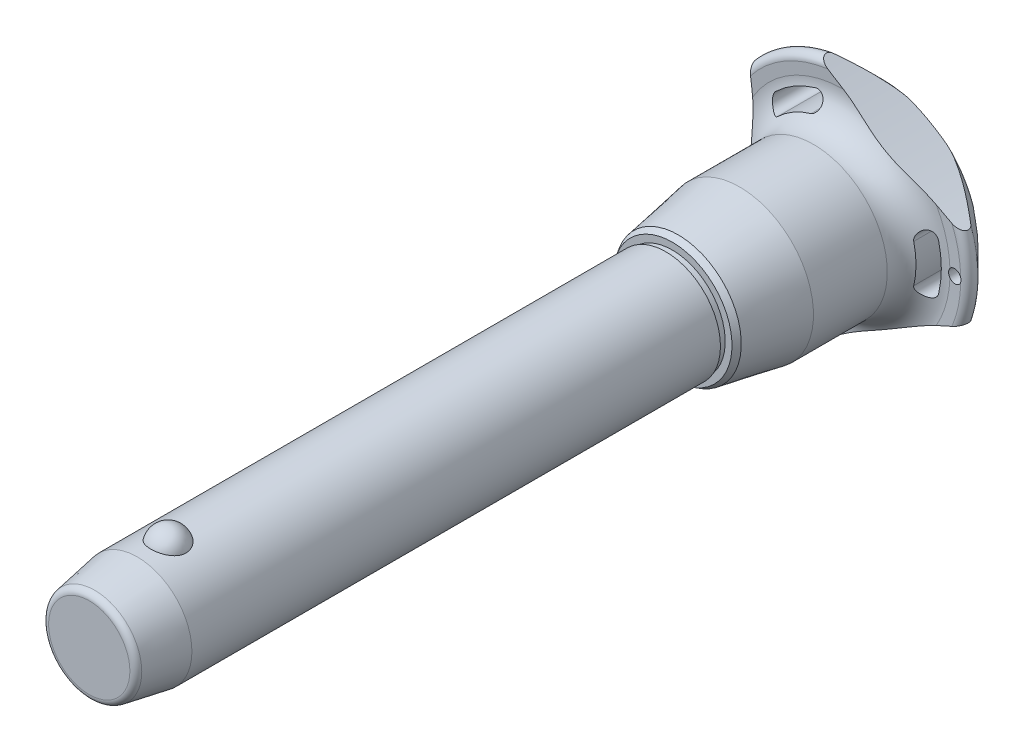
from build123d import *

# Parameters (mm, degrees)
SKETCH1_R           = 12.5
BOSS_EXTRUDE1_DEPTH = 110
SKETCH2_R           = 10
BOSS_EXTRUDE2_DEPTH = 50.7
BOSS_EXTRUDE3_START = 22
SKETCH1_2_R         = 12.5
BOSS_EXTRUDE3_DEPTH = 22
CHAMFER1_SIZE       = 11
CHAMFER1_SIZE2      = 1.939596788
FILLET1_R           = 1.5
SKETCH6_R           = 176.92625
CUT_EXTRUDE1_DEPTH  = 166.695054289
CIRPATTERN1_COUNT   = 3
SKETCH7_R           = 1.5
CUT_EXTRUDE2_DEPTH  = 166.603156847


with BuildPart() as part:
    # Sketch1 → Boss-Extrude1 (new body)
    with BuildSketch(Plane.XY):
        Circle(SKETCH1_R)
    extrude(amount=-BOSS_EXTRUDE1_DEPTH)

    # Sketch2 → Boss-Extrude2 (add)
    with BuildSketch(Plane(origin=(0, 0, -110), x_dir=(-1, 0, 0), z_dir=(0, 0, -1))):
        with Locations(Location((0, 0, 0), (0, 0, 180))):
            Circle(SKETCH2_R)
    extrude(amount=BOSS_EXTRUDE2_DEPTH)

    # Sketch3 → Revolve1 (revolve)
    with BuildSketch(Plane(origin=(0, 0, 0), x_dir=(0, 0, -1), z_dir=(1, 0, 0))):
        with BuildLine():
            Line((-3.957271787, 15.4), (-3.957271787, 7.1))
            ThreePointArc((-3.957271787, 7.1), (0.192728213, 11.25), (-3.957271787, 15.4))
        make_face()
        with BuildLine():
            Line((-3.957271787, -7.1), (-3.957271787, -15.4))
            ThreePointArc((-3.957271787, -15.4), (0.192728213, -11.25), (-3.957271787, -7.1))
        make_face()
    revolve(axis=Axis((0, -7.1, 3.957271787), (0, 1, 0)))

    # Sketch1_2 → Boss-Extrude3 (add)
    with BuildSketch(Plane.XY.offset(BOSS_EXTRUDE3_START)):
        Circle(SKETCH1_2_R)
    extrude(amount=-BOSS_EXTRUDE3_DEPTH)

    # Chamfer1
    chamfer1_edges = [part.edges().sort_by_distance(p)[0] for p in [
        (-12.5, 0, 22),
    ]]
    chamfer1_side = [part.faces().sort_by_distance(p)[0] for p in [
        (-12.5, 0, -44),
    ]]
    chamfer(chamfer1_edges, length=CHAMFER1_SIZE, length2=CHAMFER1_SIZE2, reference=chamfer1_side[0])

    # Fillet1
    fillet1_edges = [part.edges().sort_by_distance(p)[0] for p in [
        (-10.560403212, 0, 22),
        (-10, 0, -160.7),
    ]]
    fillet(fillet1_edges, radius=FILLET1_R)

    # Sketch4 → Revolve2 (revolve)
    with BuildSketch(Plane(origin=(0, 0, 0), x_dir=(0, 0, -1), z_dir=(1, 0, 0)), mode=Mode.PRIVATE) as revolve2_sk:
        Polygon((110, 0), (110, 12.089202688), (111.5, 12.089202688), (111.5, 13.644437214), (112.846872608, 14.422054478), (126.9, 16.9), (143.8, 16.9), (143.8, 0), align=None)
    revolve(revolve2_sk.sketch.rotate(Axis((0, 0, -143.8), (0, 0, 1)), 90), axis=Axis((0, 0, -143.8), (0, 0, 1)))

    # Sketch5 → Revolve3 (revolve)
    with BuildSketch(Plane(origin=(0, 0, 0), x_dir=(0, 0, -1), z_dir=(1, 0, 0)), mode=Mode.PRIVATE) as revolve3_sk:
        with BuildLine():
            Line((150.790129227, 24.271609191), (150.652256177, 26.865060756))
            ThreePointArc((150.652256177, 26.865060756), (151.598671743, 28.411427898), (153.38137085, 28.08137085))
            Line((153.38137085, 28.08137085), (159.763226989, 21.69951471))
            ThreePointArc((159.763226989, 21.69951471), (160.7, 19.381044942), (159.683055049, 17.096604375))
            ThreePointArc((159.683055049, 17.096604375), (154.18864484, 9.321268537), (152.25, 0))
            Line((152.25, 0), (143.8, 0))
            Line((143.8, 0), (143.8, 16.9))
            ThreePointArc((143.8, 16.9), (148.879432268, 19.083427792), (150.790129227, 24.271609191))
        make_face()
    revolve(revolve3_sk.sketch.rotate(Axis((0, 0, -152.25), (0, 0, 1)), 90), axis=Axis((0, 0, -152.25), (0, 0, 1)))

    # Sketch6 → Cut-Extrude1 (cut, through all)
    with BuildSketch(Plane.XY):
        with Locations((-197.42625, 0)):
            Circle(SKETCH6_R)
        with BuildLine():
            ThreePointArc((21.802992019, -5.260839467), (22.428706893, 0), (21.802992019, 5.260839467))
            ThreePointArc((21.802992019, 5.260839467), (19.579234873, 6.620060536), (18.220013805, 4.39630339))
            ThreePointArc((18.220013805, 4.39630339), (18.742902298, 0), (18.220013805, -4.39630339))
            ThreePointArc((18.220013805, -4.39630339), (19.579234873, -6.620060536), (21.802992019, -5.260839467))
        make_face()
    cut_extrude1 = extrude(amount=-CUT_EXTRUDE1_DEPTH, mode=Mode.SUBTRACT)

    # CirPattern1: Cut-Extrude1 ×3 about axis
    cirpattern1_axis = Axis((0, 0, 0), (0, 0, 1))
    for i in range(1, CIRPATTERN1_COUNT):
        add(cut_extrude1.rotate(cirpattern1_axis, i * 360 / CIRPATTERN1_COUNT), mode=Mode.SUBTRACT)

    # Sketch7 → Cut-Extrude2 (cut, through all)
    with BuildSketch(Plane.XY):
        with Locations(Location((25.428706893, 0, 0), (0, 0, 17.230769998))):
            Circle(SKETCH7_R)
    extrude(amount=-CUT_EXTRUDE2_DEPTH, mode=Mode.SUBTRACT)


solid = part.part
